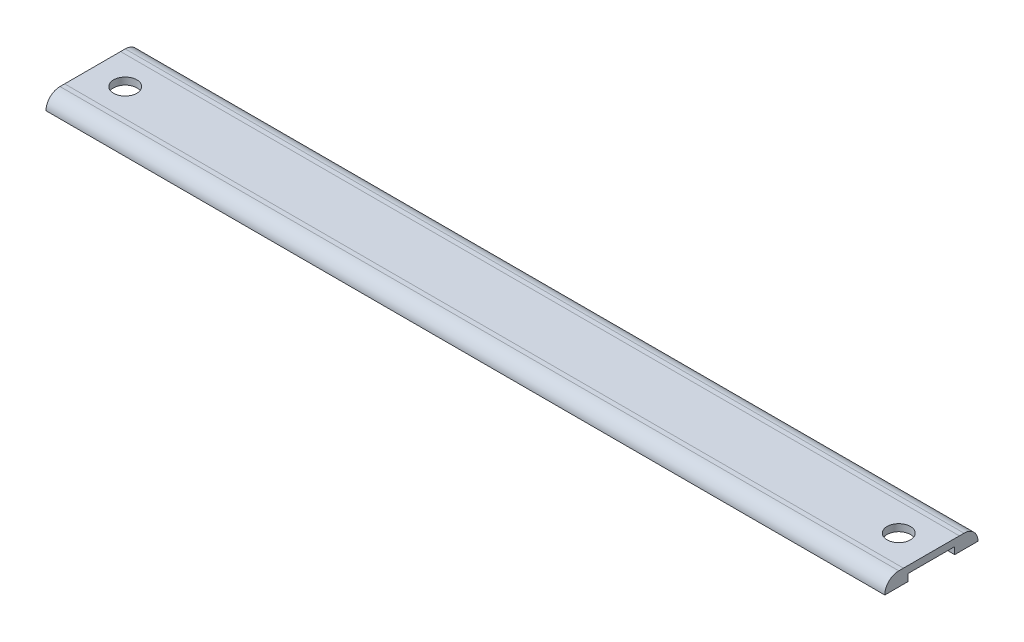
ISO-10303-21;
HEADER;
FILE_DESCRIPTION(('STEP AP214'),'2;1');
FILE_NAME('part.step','',(''),(''),'','','');
FILE_SCHEMA(('AUTOMOTIVE_DESIGN { 1 0 10303 214 1 1 1 1 }'));
ENDSEC;
DATA;
#1=APPLICATION_CONTEXT('core data for automotive mechanical design processes');
#2=APPLICATION_PROTOCOL_DEFINITION('international standard','automotive_design',2000,#1);
#3=PRODUCT_CONTEXT('',#1,'mechanical');
#4=PRODUCT('Part','Part','',(#3));
#5=PRODUCT_RELATED_PRODUCT_CATEGORY('part','',(#4));
#6=PRODUCT_DEFINITION_FORMATION('','',#4);
#7=PRODUCT_DEFINITION_CONTEXT('part definition',#1,'design');
#8=PRODUCT_DEFINITION('design','',#6,#7);
#9=PRODUCT_DEFINITION_SHAPE('','',#8);
#10=(LENGTH_UNIT() NAMED_UNIT(*) SI_UNIT(.MILLI.,.METRE.));
#11=(NAMED_UNIT(*) PLANE_ANGLE_UNIT() SI_UNIT($,.RADIAN.));
#12=(NAMED_UNIT(*) SI_UNIT($,.STERADIAN.) SOLID_ANGLE_UNIT());
#13=UNCERTAINTY_MEASURE_WITH_UNIT(LENGTH_MEASURE(1.E-05),#10,'distance_accuracy_value','');
#14=(GEOMETRIC_REPRESENTATION_CONTEXT(3) GLOBAL_UNCERTAINTY_ASSIGNED_CONTEXT((#13)) GLOBAL_UNIT_ASSIGNED_CONTEXT((#10,
#11,#12)) REPRESENTATION_CONTEXT('',''));
#15=CARTESIAN_POINT('',(0.,0.,0.));
#16=DIRECTION('',(0.,0.,1.));
#17=DIRECTION('',(1.,0.,0.));
#18=AXIS2_PLACEMENT_3D('',#15,#16,#17);
#19=CARTESIAN_POINT('',(50.,2.13734877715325,49.7811368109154));
#20=DIRECTION('',(0.,-1.,0.));
#21=DIRECTION('',(0.,0.,-1.));
#22=AXIS2_PLACEMENT_3D('',#19,#20,#21);
#23=PLANE('',#22);
#24=DIRECTION('',(0.,0.,1.));
#25=VECTOR('',#24,1.);
#26=CARTESIAN_POINT('',(171.936219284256,2.13734877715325,49.7811368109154));
#27=LINE('',#26,#25);
#28=CARTESIAN_POINT('',(171.936219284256,2.13734877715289,102.781136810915));
#29=VERTEX_POINT('',#28);
#30=CARTESIAN_POINT('',(171.936219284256,2.13734877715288,103.781136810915));
#31=VERTEX_POINT('',#30);
#32=EDGE_CURVE('E73',#29,#31,#27,.T.);
#33=ORIENTED_EDGE('',*,*,#32,.F.);
#34=DIRECTION('',(1.,0.,0.));
#35=VECTOR('',#34,1.);
#36=CARTESIAN_POINT('',(50.,2.13734877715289,102.781136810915));
#37=LINE('',#36,#35);
#38=CARTESIAN_POINT('',(-8.06378071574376,2.13734877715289,102.781136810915));
#39=VERTEX_POINT('',#38);
#40=EDGE_CURVE('E66',#29,#39,#37,.F.);
#41=ORIENTED_EDGE('',*,*,#40,.T.);
#42=DIRECTION('',(0.,0.,-1.));
#43=VECTOR('',#42,1.);
#44=CARTESIAN_POINT('',(-8.06378071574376,2.13734877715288,103.781136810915));
#45=LINE('',#44,#43);
#46=CARTESIAN_POINT('',(-8.06378071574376,2.13734877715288,103.781136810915));
#47=VERTEX_POINT('',#46);
#48=EDGE_CURVE('E186',#47,#39,#45,.T.);
#49=ORIENTED_EDGE('',*,*,#48,.F.);
#50=DIRECTION('',(1.,0.,0.));
#51=VECTOR('',#50,1.);
#52=CARTESIAN_POINT('',(-8.06378071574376,2.13734877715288,103.781136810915));
#53=LINE('',#52,#51);
#54=EDGE_CURVE('E174',#47,#31,#53,.T.);
#55=ORIENTED_EDGE('',*,*,#54,.T.);
#56=EDGE_LOOP('',(#33,#41,#49,#55));
#57=FACE_BOUND('',#56,.T.);
#58=ADVANCED_FACE('F57',(#57),#23,.F.);
#59=CARTESIAN_POINT('',(0.,-0.862651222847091,99.7811368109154));
#60=DIRECTION('',(0.,1.,0.));
#61=DIRECTION('',(0.,0.,1.));
#62=AXIS2_PLACEMENT_3D('',#59,#60,#61);
#63=PLANE('',#62);
#64=DIRECTION('',(0.,0.,-1.));
#65=VECTOR('',#64,1.);
#66=CARTESIAN_POINT('',(171.936219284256,-0.862651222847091,99.7811368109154));
#67=LINE('',#66,#65);
#68=CARTESIAN_POINT('',(171.936219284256,-0.862651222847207,119.781136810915));
#69=VERTEX_POINT('',#68);
#70=CARTESIAN_POINT('',(171.936219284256,-0.862651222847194,114.781136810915));
#71=VERTEX_POINT('',#70);
#72=EDGE_CURVE('E234',#69,#71,#67,.T.);
#73=ORIENTED_EDGE('',*,*,#72,.F.);
#74=DIRECTION('',(-1.,0.,0.));
#75=VECTOR('',#74,1.);
#76=CARTESIAN_POINT('',(180.,-0.862651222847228,119.781136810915));
#77=LINE('',#76,#75);
#78=CARTESIAN_POINT('',(-8.06378071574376,-0.862651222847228,119.781136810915));
#79=VERTEX_POINT('',#78);
#80=EDGE_CURVE('E156',#69,#79,#77,.T.);
#81=ORIENTED_EDGE('',*,*,#80,.T.);
#82=DIRECTION('',(0.,0.,1.));
#83=VECTOR('',#82,1.);
#84=CARTESIAN_POINT('',(-8.06378071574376,-0.862651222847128,114.781136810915));
#85=LINE('',#84,#83);
#86=CARTESIAN_POINT('',(-8.06378071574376,-0.862651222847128,114.781136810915));
#87=VERTEX_POINT('',#86);
#88=EDGE_CURVE('E208',#87,#79,#85,.T.);
#89=ORIENTED_EDGE('',*,*,#88,.F.);
#90=DIRECTION('',(-1.,0.,0.));
#91=VECTOR('',#90,1.);
#92=CARTESIAN_POINT('',(181.936219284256,-0.862651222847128,114.781136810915));
#93=LINE('',#92,#91);
#94=EDGE_CURVE('E173',#71,#87,#93,.T.);
#95=ORIENTED_EDGE('',*,*,#94,.F.);
#96=EDGE_LOOP('',(#73,#81,#89,#95));
#97=FACE_BOUND('',#96,.T.);
#98=ADVANCED_FACE('F59',(#97),#63,.F.);
#99=DIRECTION('',(0.,0.,1.));
#100=VECTOR('',#99,1.);
#101=CARTESIAN_POINT('',(171.936219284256,2.13734877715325,49.7811368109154));
#102=LINE('',#101,#100);
#103=CARTESIAN_POINT('',(171.936219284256,2.1373487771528,115.781136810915));
#104=VERTEX_POINT('',#103);
#105=CARTESIAN_POINT('',(171.936219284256,2.13734877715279,116.781136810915));
#106=VERTEX_POINT('',#105);
#107=EDGE_CURVE('E242',#104,#106,#102,.T.);
#108=ORIENTED_EDGE('',*,*,#107,.F.);
#109=DIRECTION('',(1.,0.,0.));
#110=VECTOR('',#109,1.);
#111=CARTESIAN_POINT('',(-8.06378071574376,2.1373487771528,115.781136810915));
#112=LINE('',#111,#110);
#113=CARTESIAN_POINT('',(-8.06378071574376,2.1373487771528,115.781136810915));
#114=VERTEX_POINT('',#113);
#115=EDGE_CURVE('E185',#114,#104,#112,.T.);
#116=ORIENTED_EDGE('',*,*,#115,.F.);
#117=DIRECTION('',(0.,0.,-1.));
#118=VECTOR('',#117,1.);
#119=CARTESIAN_POINT('',(-8.06378071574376,2.13734877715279,116.781136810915));
#120=LINE('',#119,#118);
#121=CARTESIAN_POINT('',(-8.06378071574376,2.13734877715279,116.781136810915));
#122=VERTEX_POINT('',#121);
#123=EDGE_CURVE('E197',#122,#114,#120,.T.);
#124=ORIENTED_EDGE('',*,*,#123,.F.);
#125=DIRECTION('',(-1.,0.,0.));
#126=VECTOR('',#125,1.);
#127=CARTESIAN_POINT('',(50.,2.13734877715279,116.781136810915));
#128=LINE('',#127,#126);
#129=EDGE_CURVE('E155',#122,#106,#128,.F.);
#130=ORIENTED_EDGE('',*,*,#129,.T.);
#131=EDGE_LOOP('',(#108,#116,#124,#130));
#132=FACE_BOUND('',#131,.T.);
#133=ADVANCED_FACE('F280',(#132),#23,.F.);
#134=CARTESIAN_POINT('',(180.,-0.862651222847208,116.781136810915));
#135=DIRECTION('',(-1.,0.,0.));
#136=DIRECTION('',(0.,0.,-1.));
#137=AXIS2_PLACEMENT_3D('',#134,#135,#136);
#138=CYLINDRICAL_SURFACE('',#137,3.);
#139=ORIENTED_EDGE('',*,*,#80,.F.);
#140=CARTESIAN_POINT('',(171.936219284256,-0.862651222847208,116.781136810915));
#141=DIRECTION('',(1.,0.,0.));
#142=DIRECTION('',(0.,0.,-1.));
#143=AXIS2_PLACEMENT_3D('',#140,#141,#142);
#144=CIRCLE('',#143,3.);
#145=EDGE_CURVE('E148',#69,#106,#144,.F.);
#146=ORIENTED_EDGE('',*,*,#145,.T.);
#147=ORIENTED_EDGE('',*,*,#129,.F.);
#148=CARTESIAN_POINT('',(-8.06378071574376,-0.862651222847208,116.781136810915));
#149=DIRECTION('',(-1.,0.,0.));
#150=DIRECTION('',(0.,0.,1.));
#151=AXIS2_PLACEMENT_3D('',#148,#149,#150);
#152=CIRCLE('',#151,3.);
#153=EDGE_CURVE('E204',#79,#122,#152,.T.);
#154=ORIENTED_EDGE('',*,*,#153,.F.);
#155=EDGE_LOOP('',(#139,#146,#147,#154));
#156=FACE_BOUND('',#155,.T.);
#157=ADVANCED_FACE('F284',(#156),#138,.T.);
#158=CARTESIAN_POINT('',(50.0000000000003,-0.862651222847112,102.781136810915));
#159=DIRECTION('',(1.,0.,0.));
#160=DIRECTION('',(0.,0.,1.));
#161=AXIS2_PLACEMENT_3D('',#158,#159,#160);
#162=CYLINDRICAL_SURFACE('',#161,3.);
#163=ORIENTED_EDGE('',*,*,#40,.F.);
#164=CARTESIAN_POINT('',(171.936219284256,-0.862651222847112,102.781136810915));
#165=DIRECTION('',(1.,0.,0.));
#166=DIRECTION('',(0.,0.,-1.));
#167=AXIS2_PLACEMENT_3D('',#164,#165,#166);
#168=CIRCLE('',#167,3.);
#169=CARTESIAN_POINT('',(171.936219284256,-0.862651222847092,99.7811368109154));
#170=VERTEX_POINT('',#169);
#171=EDGE_CURVE('E134',#29,#170,#168,.F.);
#172=ORIENTED_EDGE('',*,*,#171,.T.);
#173=DIRECTION('',(1.,0.,0.));
#174=VECTOR('',#173,1.);
#175=CARTESIAN_POINT('',(50.0000000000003,-0.862651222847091,99.7811368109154));
#176=LINE('',#175,#174);
#177=CARTESIAN_POINT('',(-8.06378071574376,-0.862651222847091,99.7811368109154));
#178=VERTEX_POINT('',#177);
#179=EDGE_CURVE('E145',#178,#170,#176,.T.);
#180=ORIENTED_EDGE('',*,*,#179,.F.);
#181=CARTESIAN_POINT('',(-8.06378071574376,-0.862651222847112,102.781136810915));
#182=DIRECTION('',(-1.,0.,0.));
#183=DIRECTION('',(0.,0.,1.));
#184=AXIS2_PLACEMENT_3D('',#181,#182,#183);
#185=CIRCLE('',#184,2.99999999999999);
#186=EDGE_CURVE('E182',#39,#178,#185,.T.);
#187=ORIENTED_EDGE('',*,*,#186,.F.);
#188=EDGE_LOOP('',(#163,#172,#180,#187));
#189=FACE_BOUND('',#188,.T.);
#190=ADVANCED_FACE('F144',(#189),#162,.T.);
#191=DIRECTION('',(0.,0.,-1.));
#192=VECTOR('',#191,1.);
#193=CARTESIAN_POINT('',(171.936219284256,-0.862651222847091,99.7811368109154));
#194=LINE('',#193,#192);
#195=CARTESIAN_POINT('',(171.936219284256,-0.862651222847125,104.781136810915));
#196=VERTEX_POINT('',#195);
#197=EDGE_CURVE('E131',#196,#170,#194,.T.);
#198=ORIENTED_EDGE('',*,*,#197,.F.);
#199=DIRECTION('',(-1.,0.,0.));
#200=VECTOR('',#199,1.);
#201=CARTESIAN_POINT('',(181.936219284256,-0.862651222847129,104.781136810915));
#202=LINE('',#201,#200);
#203=CARTESIAN_POINT('',(-8.06378071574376,-0.862651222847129,104.781136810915));
#204=VERTEX_POINT('',#203);
#205=EDGE_CURVE('E165',#196,#204,#202,.T.);
#206=ORIENTED_EDGE('',*,*,#205,.T.);
#207=DIRECTION('',(0.,0.,1.));
#208=VECTOR('',#207,1.);
#209=CARTESIAN_POINT('',(-8.06378071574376,-0.862651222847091,99.7811368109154));
#210=LINE('',#209,#208);
#211=EDGE_CURVE('E152',#178,#204,#210,.T.);
#212=ORIENTED_EDGE('',*,*,#211,.F.);
#213=ORIENTED_EDGE('',*,*,#179,.T.);
#214=EDGE_LOOP('',(#198,#206,#212,#213));
#215=FACE_BOUND('',#214,.T.);
#216=ADVANCED_FACE('F150',(#215),#63,.F.);
#217=CARTESIAN_POINT('',(50.,0.63734877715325,49.7811368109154));
#218=DIRECTION('',(0.,-1.,0.));
#219=DIRECTION('',(0.,0.,-1.));
#220=AXIS2_PLACEMENT_3D('',#217,#218,#219);
#221=PLANE('',#220);
#222=CARTESIAN_POINT('',(-1.06378071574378,0.63734877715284,109.781136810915));
#223=DIRECTION('',(0.,-1.,0.));
#224=DIRECTION('',(0.,0.,-1.));
#225=AXIS2_PLACEMENT_3D('',#222,#223,#224);
#226=CIRCLE('',#225,2.50000000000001);
#227=CARTESIAN_POINT('',(-1.06378071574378,0.637348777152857,107.281136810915));
#228=VERTEX_POINT('',#227);
#229=EDGE_CURVE('E245',#228,#228,#226,.T.);
#230=ORIENTED_EDGE('',*,*,#229,.F.);
#231=EDGE_LOOP('',(#230));
#232=FACE_BOUND('',#231,.T.);
#233=CARTESIAN_POINT('',(164.936219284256,0.63734877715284,109.781136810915));
#234=DIRECTION('',(0.,-1.,0.));
#235=DIRECTION('',(0.,0.,-1.));
#236=AXIS2_PLACEMENT_3D('',#233,#234,#235);
#237=CIRCLE('',#236,2.5);
#238=CARTESIAN_POINT('',(164.936219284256,0.637348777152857,107.281136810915));
#239=VERTEX_POINT('',#238);
#240=EDGE_CURVE('E249',#239,#239,#237,.T.);
#241=ORIENTED_EDGE('',*,*,#240,.F.);
#242=EDGE_LOOP('',(#241));
#243=FACE_BOUND('',#242,.T.);
#244=DIRECTION('',(-1.,0.,0.));
#245=VECTOR('',#244,1.);
#246=CARTESIAN_POINT('',(181.936219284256,0.637348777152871,104.781136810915));
#247=LINE('',#246,#245);
#248=CARTESIAN_POINT('',(171.936219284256,0.637348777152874,104.781136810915));
#249=VERTEX_POINT('',#248);
#250=CARTESIAN_POINT('',(-8.06378071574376,0.637348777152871,104.781136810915));
#251=VERTEX_POINT('',#250);
#252=EDGE_CURVE('E163',#249,#251,#247,.T.);
#253=ORIENTED_EDGE('',*,*,#252,.F.);
#254=DIRECTION('',(0.,0.,1.));
#255=VECTOR('',#254,1.);
#256=CARTESIAN_POINT('',(171.936219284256,0.63734877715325,49.7811368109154));
#257=LINE('',#256,#255);
#258=CARTESIAN_POINT('',(171.936219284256,0.637348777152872,114.781136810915));
#259=VERTEX_POINT('',#258);
#260=EDGE_CURVE('E141',#249,#259,#257,.T.);
#261=ORIENTED_EDGE('',*,*,#260,.T.);
#262=DIRECTION('',(-1.,0.,0.));
#263=VECTOR('',#262,1.);
#264=CARTESIAN_POINT('',(181.936219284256,0.637348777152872,114.781136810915));
#265=LINE('',#264,#263);
#266=CARTESIAN_POINT('',(-8.06378071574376,0.637348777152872,114.781136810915));
#267=VERTEX_POINT('',#266);
#268=EDGE_CURVE('E177',#259,#267,#265,.T.);
#269=ORIENTED_EDGE('',*,*,#268,.T.);
#270=DIRECTION('',(0.,0.,1.));
#271=VECTOR('',#270,1.);
#272=CARTESIAN_POINT('',(-8.06378071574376,0.637348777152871,104.781136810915));
#273=LINE('',#272,#271);
#274=EDGE_CURVE('E216',#251,#267,#273,.T.);
#275=ORIENTED_EDGE('',*,*,#274,.F.);
#276=EDGE_LOOP('',(#253,#261,#269,#275));
#277=FACE_BOUND('',#276,.T.);
#278=ADVANCED_FACE('F295',(#232,#243,#277),#221,.T.);
#279=CARTESIAN_POINT('',(181.936219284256,-0.862651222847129,104.781136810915));
#280=DIRECTION('',(0.,0.,-1.));
#281=DIRECTION('',(-1.,0.,0.));
#282=AXIS2_PLACEMENT_3D('',#279,#280,#281);
#283=PLANE('',#282);
#284=DIRECTION('',(0.,-1.,0.));
#285=VECTOR('',#284,1.);
#286=CARTESIAN_POINT('',(171.936219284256,-0.862651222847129,104.781136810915));
#287=LINE('',#286,#285);
#288=EDGE_CURVE('E136',#249,#196,#287,.T.);
#289=ORIENTED_EDGE('',*,*,#288,.F.);
#290=ORIENTED_EDGE('',*,*,#252,.T.);
#291=DIRECTION('',(0.,1.,0.));
#292=VECTOR('',#291,1.);
#293=CARTESIAN_POINT('',(-8.06378071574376,-0.862651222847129,104.781136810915));
#294=LINE('',#293,#292);
#295=EDGE_CURVE('E220',#204,#251,#294,.T.);
#296=ORIENTED_EDGE('',*,*,#295,.F.);
#297=ORIENTED_EDGE('',*,*,#205,.F.);
#298=EDGE_LOOP('',(#289,#290,#296,#297));
#299=FACE_BOUND('',#298,.T.);
#300=ADVANCED_FACE('F297',(#299),#283,.F.);
#301=CARTESIAN_POINT('',(181.936219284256,-0.862651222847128,114.781136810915));
#302=DIRECTION('',(0.,0.,1.));
#303=DIRECTION('',(1.,0.,0.));
#304=AXIS2_PLACEMENT_3D('',#301,#302,#303);
#305=PLANE('',#304);
#306=DIRECTION('',(0.,1.,0.));
#307=VECTOR('',#306,1.);
#308=CARTESIAN_POINT('',(171.936219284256,-0.862651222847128,114.781136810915));
#309=LINE('',#308,#307);
#310=EDGE_CURVE('E231',#71,#259,#309,.T.);
#311=ORIENTED_EDGE('',*,*,#310,.F.);
#312=ORIENTED_EDGE('',*,*,#94,.T.);
#313=DIRECTION('',(0.,-1.,0.));
#314=VECTOR('',#313,1.);
#315=CARTESIAN_POINT('',(-8.06378071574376,0.637348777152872,114.781136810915));
#316=LINE('',#315,#314);
#317=EDGE_CURVE('E212',#267,#87,#316,.T.);
#318=ORIENTED_EDGE('',*,*,#317,.F.);
#319=ORIENTED_EDGE('',*,*,#268,.F.);
#320=EDGE_LOOP('',(#311,#312,#318,#319));
#321=FACE_BOUND('',#320,.T.);
#322=ADVANCED_FACE('F270',(#321),#305,.F.);
#323=CARTESIAN_POINT('',(-8.06378071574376,-0.862651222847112,102.781136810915));
#324=DIRECTION('',(-1.,0.,0.));
#325=DIRECTION('',(0.,0.,1.));
#326=AXIS2_PLACEMENT_3D('',#323,#324,#325);
#327=PLANE('',#326);
#328=ORIENTED_EDGE('',*,*,#186,.T.);
#329=ORIENTED_EDGE('',*,*,#211,.T.);
#330=ORIENTED_EDGE('',*,*,#295,.T.);
#331=ORIENTED_EDGE('',*,*,#274,.T.);
#332=ORIENTED_EDGE('',*,*,#317,.T.);
#333=ORIENTED_EDGE('',*,*,#88,.T.);
#334=ORIENTED_EDGE('',*,*,#153,.T.);
#335=ORIENTED_EDGE('',*,*,#123,.T.);
#336=DIRECTION('',(0.,0.,-1.));
#337=VECTOR('',#336,1.);
#338=CARTESIAN_POINT('',(-8.06378071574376,2.1373487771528,115.781136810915));
#339=LINE('',#338,#337);
#340=EDGE_CURVE('E190',#114,#47,#339,.T.);
#341=ORIENTED_EDGE('',*,*,#340,.T.);
#342=ORIENTED_EDGE('',*,*,#48,.T.);
#343=EDGE_LOOP('',(#328,#329,#330,#331,#332,#333,#334,#335,#341,#342));
#344=FACE_BOUND('',#343,.T.);
#345=ADVANCED_FACE('F268',(#344),#327,.T.);
#346=CARTESIAN_POINT('',(-8.06378071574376,2.1373487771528,115.781136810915));
#347=DIRECTION('',(0.,-1.,0.));
#348=DIRECTION('',(0.,0.,-1.));
#349=AXIS2_PLACEMENT_3D('',#346,#347,#348);
#350=PLANE('',#349);
#351=CARTESIAN_POINT('',(-1.06378071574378,2.13734877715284,109.781136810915));
#352=DIRECTION('',(0.,1.,0.));
#353=DIRECTION('',(0.,0.,1.));
#354=AXIS2_PLACEMENT_3D('',#351,#352,#353);
#355=CIRCLE('',#354,2.50000000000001);
#356=CARTESIAN_POINT('',(-1.06378071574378,2.13734877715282,112.281136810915));
#357=VERTEX_POINT('',#356);
#358=EDGE_CURVE('E253',#357,#357,#355,.T.);
#359=ORIENTED_EDGE('',*,*,#358,.F.);
#360=EDGE_LOOP('',(#359));
#361=FACE_BOUND('',#360,.T.);
#362=CARTESIAN_POINT('',(164.936219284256,2.13734877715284,109.781136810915));
#363=DIRECTION('',(0.,1.,0.));
#364=DIRECTION('',(0.,0.,1.));
#365=AXIS2_PLACEMENT_3D('',#362,#363,#364);
#366=CIRCLE('',#365,2.5);
#367=CARTESIAN_POINT('',(164.936219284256,2.13734877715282,112.281136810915));
#368=VERTEX_POINT('',#367);
#369=EDGE_CURVE('E254',#368,#368,#366,.T.);
#370=ORIENTED_EDGE('',*,*,#369,.F.);
#371=EDGE_LOOP('',(#370));
#372=FACE_BOUND('',#371,.T.);
#373=ORIENTED_EDGE('',*,*,#54,.F.);
#374=ORIENTED_EDGE('',*,*,#340,.F.);
#375=ORIENTED_EDGE('',*,*,#115,.T.);
#376=DIRECTION('',(0.,0.,-1.));
#377=VECTOR('',#376,1.);
#378=CARTESIAN_POINT('',(171.936219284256,2.13734877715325,49.7811368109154));
#379=LINE('',#378,#377);
#380=EDGE_CURVE('E12',#104,#31,#379,.T.);
#381=ORIENTED_EDGE('',*,*,#380,.T.);
#382=EDGE_LOOP('',(#373,#374,#375,#381));
#383=FACE_BOUND('',#382,.T.);
#384=ADVANCED_FACE('F265',(#361,#372,#383),#350,.F.);
#385=CARTESIAN_POINT('',(171.936219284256,10.,99.7811368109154));
#386=DIRECTION('',(1.,0.,0.));
#387=DIRECTION('',(0.,0.,-1.));
#388=AXIS2_PLACEMENT_3D('',#385,#386,#387);
#389=PLANE('',#388);
#390=ORIENTED_EDGE('',*,*,#288,.T.);
#391=ORIENTED_EDGE('',*,*,#197,.T.);
#392=ORIENTED_EDGE('',*,*,#171,.F.);
#393=ORIENTED_EDGE('',*,*,#32,.T.);
#394=ORIENTED_EDGE('',*,*,#380,.F.);
#395=ORIENTED_EDGE('',*,*,#107,.T.);
#396=ORIENTED_EDGE('',*,*,#145,.F.);
#397=ORIENTED_EDGE('',*,*,#72,.T.);
#398=ORIENTED_EDGE('',*,*,#310,.T.);
#399=ORIENTED_EDGE('',*,*,#260,.F.);
#400=EDGE_LOOP('',(#390,#391,#392,#393,#394,#395,#396,#397,#398,#399));
#401=FACE_BOUND('',#400,.T.);
#402=ADVANCED_FACE('F133',(#401),#389,.T.);
#403=CARTESIAN_POINT('',(164.936219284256,-7.93371903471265,109.781136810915));
#404=DIRECTION('',(0.,1.,0.));
#405=DIRECTION('',(0.,0.,1.));
#406=AXIS2_PLACEMENT_3D('',#403,#404,#405);
#407=CYLINDRICAL_SURFACE('',#406,2.5);
#408=ORIENTED_EDGE('',*,*,#240,.T.);
#409=EDGE_LOOP('',(#408));
#410=FACE_BOUND('',#409,.T.);
#411=ORIENTED_EDGE('',*,*,#369,.T.);
#412=EDGE_LOOP('',(#411));
#413=FACE_BOUND('',#412,.T.);
#414=ADVANCED_FACE('F358',(#410,#413),#407,.F.);
#415=CARTESIAN_POINT('',(-1.06378071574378,-7.93371903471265,109.781136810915));
#416=DIRECTION('',(0.,1.,0.));
#417=DIRECTION('',(0.,0.,1.));
#418=AXIS2_PLACEMENT_3D('',#415,#416,#417);
#419=CYLINDRICAL_SURFACE('',#418,2.50000000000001);
#420=ORIENTED_EDGE('',*,*,#229,.T.);
#421=EDGE_LOOP('',(#420));
#422=FACE_BOUND('',#421,.T.);
#423=ORIENTED_EDGE('',*,*,#358,.T.);
#424=EDGE_LOOP('',(#423));
#425=FACE_BOUND('',#424,.T.);
#426=ADVANCED_FACE('F263',(#422,#425),#419,.F.);
#427=CLOSED_SHELL('',(#58,#98,#133,#157,#190,#216,#278,#300,#322,#345,#384,#402,#414,#426));
#428=MANIFOLD_SOLID_BREP('B2',#427);
#429=ADVANCED_BREP_SHAPE_REPRESENTATION('',(#18,#428),#14);
#430=SHAPE_DEFINITION_REPRESENTATION(#9,#429);
ENDSEC;
END-ISO-10303-21;
